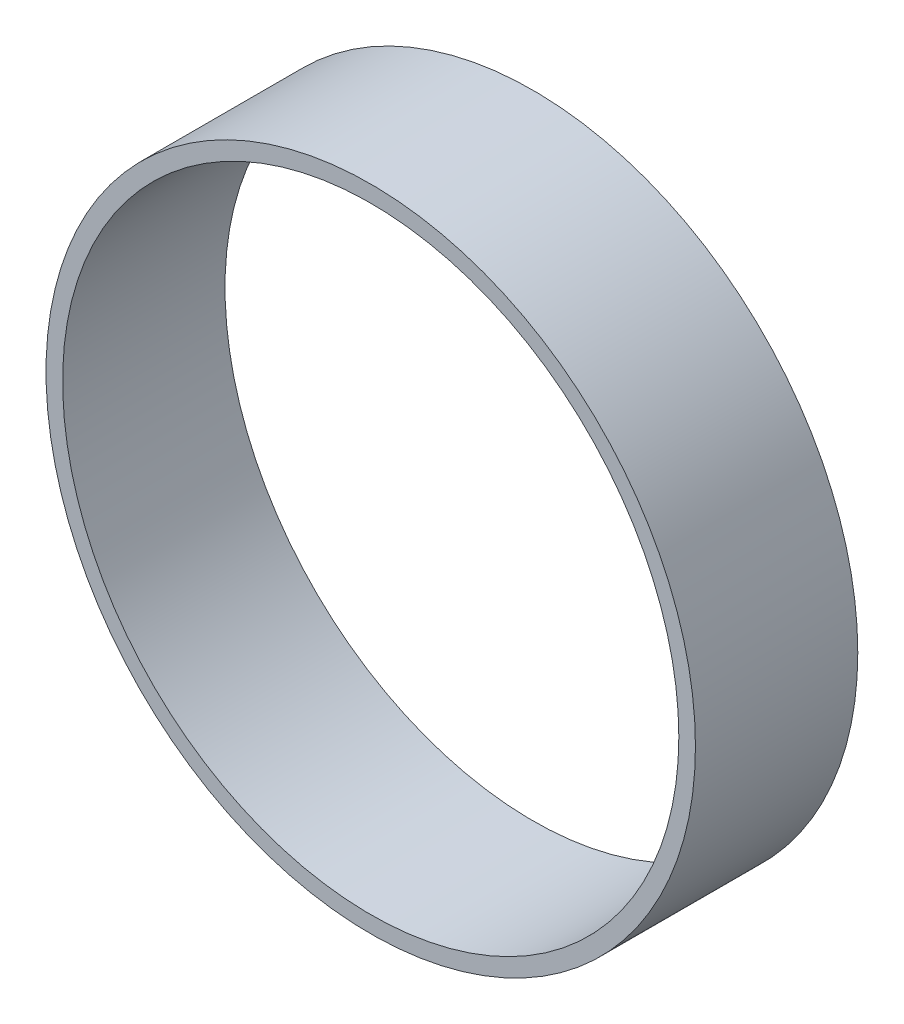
ISO-10303-21;
HEADER;
FILE_DESCRIPTION(('STEP AP214'),'2;1');
FILE_NAME('part.step','',(''),(''),'','','');
FILE_SCHEMA(('AUTOMOTIVE_DESIGN { 1 0 10303 214 1 1 1 1 }'));
ENDSEC;
DATA;
#1=APPLICATION_CONTEXT('core data for automotive mechanical design processes');
#2=APPLICATION_PROTOCOL_DEFINITION('international standard','automotive_design',2000,#1);
#3=PRODUCT_CONTEXT('',#1,'mechanical');
#4=PRODUCT('Part','Part','',(#3));
#5=PRODUCT_RELATED_PRODUCT_CATEGORY('part','',(#4));
#6=PRODUCT_DEFINITION_FORMATION('','',#4);
#7=PRODUCT_DEFINITION_CONTEXT('part definition',#1,'design');
#8=PRODUCT_DEFINITION('design','',#6,#7);
#9=PRODUCT_DEFINITION_SHAPE('','',#8);
#10=(LENGTH_UNIT() NAMED_UNIT(*) SI_UNIT(.MILLI.,.METRE.));
#11=(NAMED_UNIT(*) PLANE_ANGLE_UNIT() SI_UNIT($,.RADIAN.));
#12=(NAMED_UNIT(*) SI_UNIT($,.STERADIAN.) SOLID_ANGLE_UNIT());
#13=UNCERTAINTY_MEASURE_WITH_UNIT(LENGTH_MEASURE(1.E-05),#10,'distance_accuracy_value','');
#14=(GEOMETRIC_REPRESENTATION_CONTEXT(3) GLOBAL_UNCERTAINTY_ASSIGNED_CONTEXT((#13)) GLOBAL_UNIT_ASSIGNED_CONTEXT((#10,
#11,#12)) REPRESENTATION_CONTEXT('',''));
#15=CARTESIAN_POINT('',(0.,0.,0.));
#16=DIRECTION('',(0.,0.,1.));
#17=DIRECTION('',(1.,0.,0.));
#18=AXIS2_PLACEMENT_3D('',#15,#16,#17);
#19=CARTESIAN_POINT('',(0.,0.,12.7));
#20=DIRECTION('',(0.,0.,1.));
#21=DIRECTION('',(1.,0.,0.));
#22=AXIS2_PLACEMENT_3D('',#19,#20,#21);
#23=PLANE('',#22);
#24=CARTESIAN_POINT('',(0.,0.,12.7));
#25=DIRECTION('',(0.,0.,1.));
#26=DIRECTION('',(1.,0.,0.));
#27=AXIS2_PLACEMENT_3D('',#24,#25,#26);
#28=CIRCLE('',#27,50.8);
#29=CARTESIAN_POINT('',(50.8,0.,12.7));
#30=VERTEX_POINT('',#29);
#31=EDGE_CURVE('E10',#30,#30,#28,.T.);
#32=ORIENTED_EDGE('',*,*,#31,.T.);
#33=EDGE_LOOP('',(#32));
#34=FACE_BOUND('',#33,.T.);
#35=CARTESIAN_POINT('',(0.,0.,12.7));
#36=DIRECTION('',(0.,0.,1.));
#37=DIRECTION('',(1.,0.,0.));
#38=AXIS2_PLACEMENT_3D('',#35,#36,#37);
#39=CIRCLE('',#38,48.2);
#40=CARTESIAN_POINT('',(48.2,0.,12.7));
#41=VERTEX_POINT('',#40);
#42=EDGE_CURVE('E48',#41,#41,#39,.T.);
#43=ORIENTED_EDGE('',*,*,#42,.F.);
#44=EDGE_LOOP('',(#43));
#45=FACE_BOUND('',#44,.T.);
#46=ADVANCED_FACE('F37',(#34,#45),#23,.T.);
#47=CARTESIAN_POINT('',(0.,0.,-12.7));
#48=DIRECTION('',(0.,0.,1.));
#49=DIRECTION('',(1.,0.,0.));
#50=AXIS2_PLACEMENT_3D('',#47,#48,#49);
#51=PLANE('',#50);
#52=CARTESIAN_POINT('',(0.,0.,-12.7));
#53=DIRECTION('',(0.,0.,1.));
#54=DIRECTION('',(1.,0.,0.));
#55=AXIS2_PLACEMENT_3D('',#52,#53,#54);
#56=CIRCLE('',#55,50.8);
#57=CARTESIAN_POINT('',(50.8,0.,-12.7));
#58=VERTEX_POINT('',#57);
#59=EDGE_CURVE('E41',#58,#58,#56,.T.);
#60=ORIENTED_EDGE('',*,*,#59,.F.);
#61=EDGE_LOOP('',(#60));
#62=FACE_BOUND('',#61,.T.);
#63=CARTESIAN_POINT('',(0.,0.,-12.7));
#64=DIRECTION('',(0.,0.,1.));
#65=DIRECTION('',(1.,0.,0.));
#66=AXIS2_PLACEMENT_3D('',#63,#64,#65);
#67=CIRCLE('',#66,48.2);
#68=CARTESIAN_POINT('',(48.2,0.,-12.7));
#69=VERTEX_POINT('',#68);
#70=EDGE_CURVE('E50',#69,#69,#67,.T.);
#71=ORIENTED_EDGE('',*,*,#70,.T.);
#72=EDGE_LOOP('',(#71));
#73=FACE_BOUND('',#72,.T.);
#74=ADVANCED_FACE('F60',(#62,#73),#51,.F.);
#75=CARTESIAN_POINT('',(0.,0.,12.7));
#76=DIRECTION('',(0.,0.,-1.));
#77=DIRECTION('',(-1.,0.,0.));
#78=AXIS2_PLACEMENT_3D('',#75,#76,#77);
#79=CYLINDRICAL_SURFACE('',#78,50.8);
#80=ORIENTED_EDGE('',*,*,#31,.F.);
#81=EDGE_LOOP('',(#80));
#82=FACE_BOUND('',#81,.T.);
#83=ORIENTED_EDGE('',*,*,#59,.T.);
#84=EDGE_LOOP('',(#83));
#85=FACE_BOUND('',#84,.T.);
#86=ADVANCED_FACE('F39',(#82,#85),#79,.T.);
#87=CARTESIAN_POINT('',(0.,0.,12.7));
#88=DIRECTION('',(0.,0.,-1.));
#89=DIRECTION('',(-1.,0.,0.));
#90=AXIS2_PLACEMENT_3D('',#87,#88,#89);
#91=CYLINDRICAL_SURFACE('',#90,48.2);
#92=ORIENTED_EDGE('',*,*,#42,.T.);
#93=EDGE_LOOP('',(#92));
#94=FACE_BOUND('',#93,.T.);
#95=ORIENTED_EDGE('',*,*,#70,.F.);
#96=EDGE_LOOP('',(#95));
#97=FACE_BOUND('',#96,.T.);
#98=ADVANCED_FACE('F56',(#94,#97),#91,.F.);
#99=CLOSED_SHELL('',(#46,#74,#86,#98));
#100=MANIFOLD_SOLID_BREP('B2',#99);
#101=ADVANCED_BREP_SHAPE_REPRESENTATION('',(#18,#100),#14);
#102=SHAPE_DEFINITION_REPRESENTATION(#9,#101);
ENDSEC;
END-ISO-10303-21;
